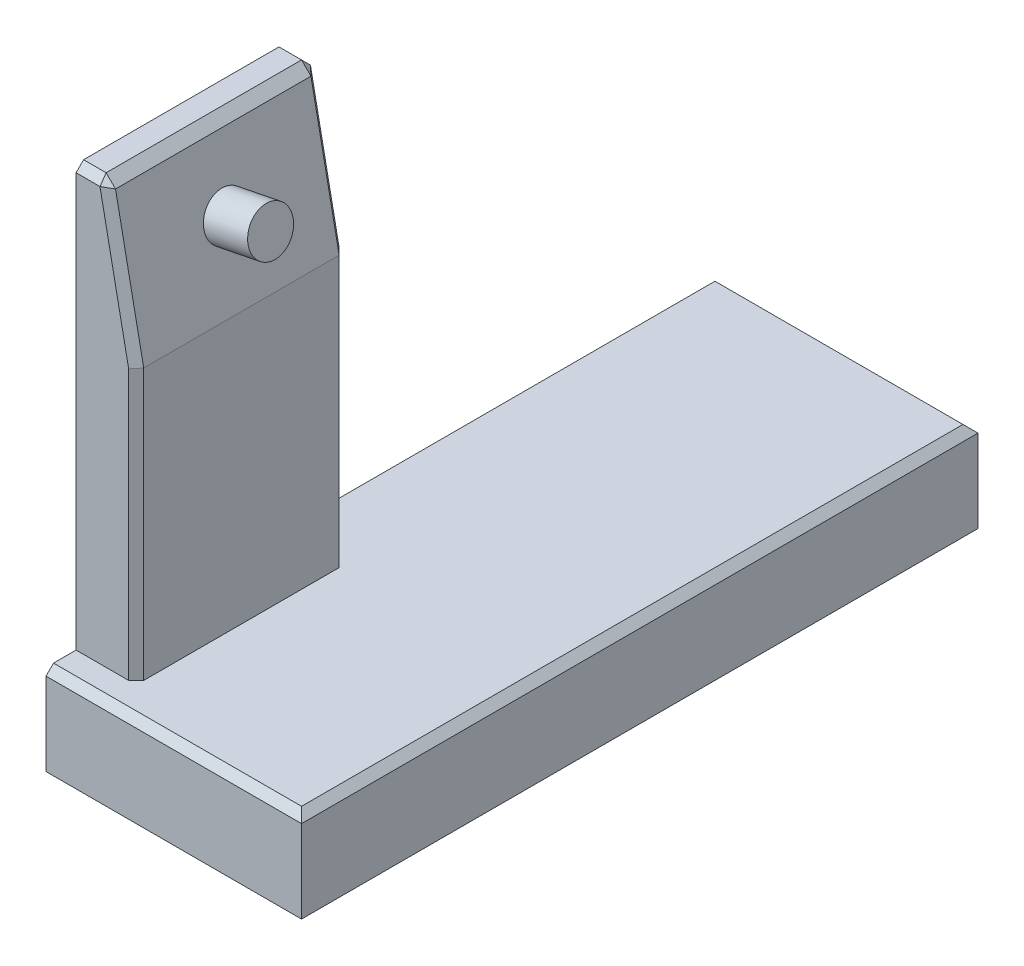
from build123d import *
from OCP.BRepFilletAPI import BRepFilletAPI_MakeChamfer

# Parameters (mm, degrees)
SKETCH1_W           = 17
SKETCH1_H           = 45
BOSS_EXTRUDE1_DEPTH = 6
SKETCH2_W           = 4
SKETCH2_H           = 14
BOSS_EXTRUDE2_DEPTH = 28
CUT_EXTRUDE1_DEPTH  = 14
SKETCH4_R           = 4
CUT_EXTRUDE2_DEPTH  = 5
SKETCH5_R           = 1.5
BOSS_EXTRUDE3_DEPTH = 3
CHAMFER1_SIZE       = 0.5
CHAMFER1_SIZE2      = 0.637377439


with BuildPart() as part:
    # Sketch1 → Boss-Extrude1 (new body)
    with BuildSketch(Plane(origin=(0, 0, 0), x_dir=(1, 0, 0), z_dir=(0, 1, 0))):
        with Locations((8.5, 22.5)):
            Rectangle(SKETCH1_W, SKETCH1_H)
    extrude(amount=BOSS_EXTRUDE1_DEPTH)

    # Sketch2 → Boss-Extrude2 (add)
    with BuildSketch(Plane(origin=(0, 6, 0), x_dir=(1, 0, 0), z_dir=(0, 1, 0))):
        with Locations((2, 9)):
            Rectangle(SKETCH2_W, SKETCH2_H)
    extrude(amount=BOSS_EXTRUDE2_DEPTH)

    # Sketch3 → Cut-Extrude1 (cut)
    with BuildSketch(Plane.XY.offset(-2)):
        Polygon((4, 34), (2, 34), (4, 24), align=None)
    extrude(amount=-CUT_EXTRUDE1_DEPTH, mode=Mode.SUBTRACT)

    # Sketch4 → Cut-Extrude2 (cut)
    with BuildSketch(Plane.XZ):
        with Locations(Location((9, -11.25, 0), (0, 0, 270))):
            Circle(SKETCH4_R)
        with Locations(Location((9, -33.75, 0), (0, 0, 270))):
            Circle(SKETCH4_R)
    extrude(amount=-CUT_EXTRUDE2_DEPTH, mode=Mode.SUBTRACT)

    # Sketch5 → Boss-Extrude3 (add)
    with BuildSketch(Plane(origin=(8.461538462, 1.692307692, 0), x_dir=(0, 0, -1), z_dir=(0.9805806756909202, 0.19611613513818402, 0))):
        with Locations(Location((9, 27.84849119, 0), (0, 0, 90))):
            Circle(SKETCH5_R)
    extrude(amount=BOSS_EXTRUDE3_DEPTH)

    # Chamfer1: one chamfer whose edges measure the first distance from different faces: ONE call of the kernel's chamfer builder (chamfer() names one face for all edges)
    chamfer1_edges_1 = [part.edges().sort_by_distance(p)[0] for p in [
        (17, 6, -22.5),
        (8.5, 6, -45),
        (1, 34, -2),
        (1, 34, -16),
        (4, 15, -16),
        (4, 15, -2),
        (3, 29, -16),
        (3, 29, -2),
        (8.5, 6, 0),
    ]]
    chamfer1_edges_2 = [part.edges().sort_by_distance(p)[0] for p in [
        (2, 34, -9),
    ]]
    chamfer1_side_2 = [part.faces().sort_by_distance(p)[0] for p in [
        (1, 34, -9),
    ]]
    chamfer1 = BRepFilletAPI_MakeChamfer(part.part.solid().wrapped)
    for e in chamfer1_edges_1:
        chamfer1.Add(CHAMFER1_SIZE, e.wrapped)
    for e in chamfer1_edges_2:
        chamfer1.Add(CHAMFER1_SIZE, CHAMFER1_SIZE2, e.wrapped, chamfer1_side_2[0].wrapped)  # the first distance lies on this face
    add(Compound.cast(chamfer1.Shape()), mode=Mode.REPLACE)


solid = part.part
